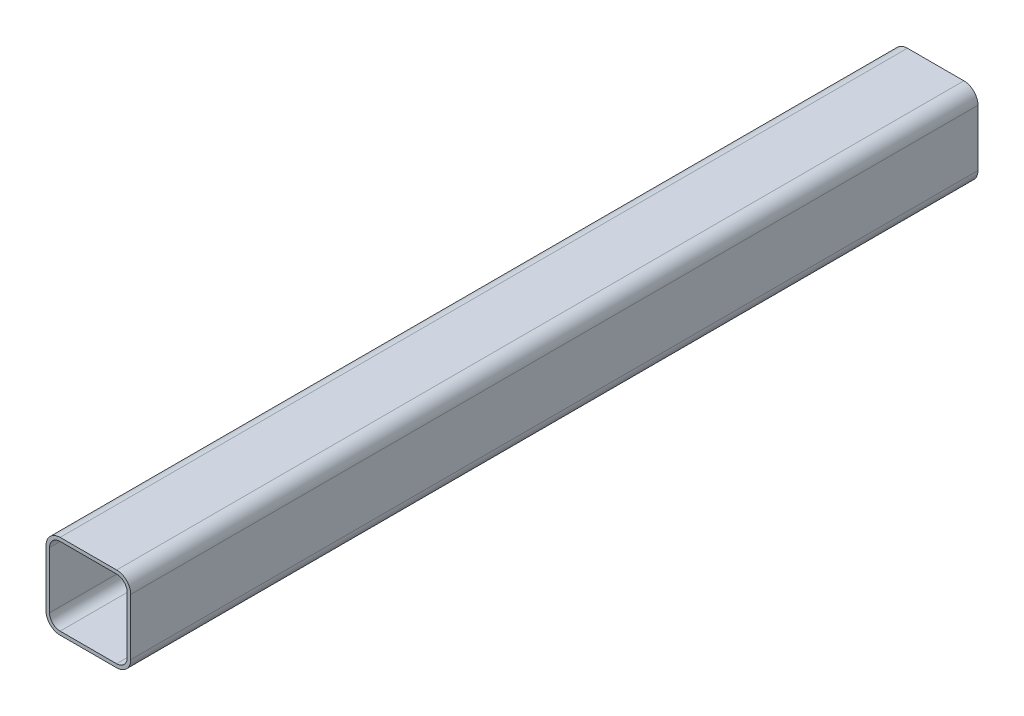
ISO-10303-21;
HEADER;
FILE_DESCRIPTION(('STEP AP214'),'2;1');
FILE_NAME('part.step','',(''),(''),'','','');
FILE_SCHEMA(('AUTOMOTIVE_DESIGN { 1 0 10303 214 1 1 1 1 }'));
ENDSEC;
DATA;
#1=APPLICATION_CONTEXT('core data for automotive mechanical design processes');
#2=APPLICATION_PROTOCOL_DEFINITION('international standard','automotive_design',2000,#1);
#3=PRODUCT_CONTEXT('',#1,'mechanical');
#4=PRODUCT('Part','Part','',(#3));
#5=PRODUCT_RELATED_PRODUCT_CATEGORY('part','',(#4));
#6=PRODUCT_DEFINITION_FORMATION('','',#4);
#7=PRODUCT_DEFINITION_CONTEXT('part definition',#1,'design');
#8=PRODUCT_DEFINITION('design','',#6,#7);
#9=PRODUCT_DEFINITION_SHAPE('','',#8);
#10=(LENGTH_UNIT() NAMED_UNIT(*) SI_UNIT(.MILLI.,.METRE.));
#11=(NAMED_UNIT(*) PLANE_ANGLE_UNIT() SI_UNIT($,.RADIAN.));
#12=(NAMED_UNIT(*) SI_UNIT($,.STERADIAN.) SOLID_ANGLE_UNIT());
#13=UNCERTAINTY_MEASURE_WITH_UNIT(LENGTH_MEASURE(1.E-05),#10,'distance_accuracy_value','');
#14=(GEOMETRIC_REPRESENTATION_CONTEXT(3) GLOBAL_UNCERTAINTY_ASSIGNED_CONTEXT((#13)) GLOBAL_UNIT_ASSIGNED_CONTEXT((#10,
#11,#12)) REPRESENTATION_CONTEXT('',''));
#15=CARTESIAN_POINT('',(0.,0.,0.));
#16=DIRECTION('',(0.,0.,1.));
#17=DIRECTION('',(1.,0.,0.));
#18=AXIS2_PLACEMENT_3D('',#15,#16,#17);
#19=CARTESIAN_POINT('',(25.4,25.4,762.));
#20=DIRECTION('',(0.,0.,1.));
#21=DIRECTION('',(1.,0.,0.));
#22=AXIS2_PLACEMENT_3D('',#19,#20,#21);
#23=PLANE('',#22);
#24=CARTESIAN_POINT('',(25.4,25.4,762.));
#25=DIRECTION('',(0.,0.,1.));
#26=DIRECTION('',(1.,0.,0.));
#27=AXIS2_PLACEMENT_3D('',#24,#25,#26);
#28=CIRCLE('',#27,12.7);
#29=CARTESIAN_POINT('',(38.1,25.4,762.));
#30=VERTEX_POINT('',#29);
#31=CARTESIAN_POINT('',(25.4,38.1,762.));
#32=VERTEX_POINT('',#31);
#33=EDGE_CURVE('E214',#30,#32,#28,.T.);
#34=ORIENTED_EDGE('',*,*,#33,.T.);
#35=DIRECTION('',(1.,0.,0.));
#36=VECTOR('',#35,1.);
#37=CARTESIAN_POINT('',(-25.4,38.1,762.));
#38=LINE('',#37,#36);
#39=CARTESIAN_POINT('',(-25.4,38.1,762.));
#40=VERTEX_POINT('',#39);
#41=EDGE_CURVE('E216',#40,#32,#38,.T.);
#42=ORIENTED_EDGE('',*,*,#41,.F.);
#43=CARTESIAN_POINT('',(-25.4,25.4,762.));
#44=DIRECTION('',(0.,0.,-1.));
#45=DIRECTION('',(-1.,0.,0.));
#46=AXIS2_PLACEMENT_3D('',#43,#44,#45);
#47=CIRCLE('',#46,12.7);
#48=CARTESIAN_POINT('',(-38.1,25.4,762.));
#49=VERTEX_POINT('',#48);
#50=EDGE_CURVE('E220',#49,#40,#47,.T.);
#51=ORIENTED_EDGE('',*,*,#50,.F.);
#52=DIRECTION('',(0.,-1.,0.));
#53=VECTOR('',#52,1.);
#54=CARTESIAN_POINT('',(-38.1,25.4,762.));
#55=LINE('',#54,#53);
#56=CARTESIAN_POINT('',(-38.1,-25.4,762.));
#57=VERTEX_POINT('',#56);
#58=EDGE_CURVE('E223',#49,#57,#55,.T.);
#59=ORIENTED_EDGE('',*,*,#58,.T.);
#60=CARTESIAN_POINT('',(-25.4,-25.4,762.));
#61=DIRECTION('',(0.,0.,-1.));
#62=DIRECTION('',(-1.,0.,0.));
#63=AXIS2_PLACEMENT_3D('',#60,#61,#62);
#64=CIRCLE('',#63,12.7);
#65=CARTESIAN_POINT('',(-25.4,-38.1,762.));
#66=VERTEX_POINT('',#65);
#67=EDGE_CURVE('E225',#66,#57,#64,.T.);
#68=ORIENTED_EDGE('',*,*,#67,.F.);
#69=DIRECTION('',(-1.,0.,0.));
#70=VECTOR('',#69,1.);
#71=CARTESIAN_POINT('',(25.4,-38.1,762.));
#72=LINE('',#71,#70);
#73=CARTESIAN_POINT('',(25.4,-38.1,762.));
#74=VERTEX_POINT('',#73);
#75=EDGE_CURVE('E228',#74,#66,#72,.T.);
#76=ORIENTED_EDGE('',*,*,#75,.F.);
#77=CARTESIAN_POINT('',(25.4,-25.4,762.));
#78=DIRECTION('',(0.,0.,-1.));
#79=DIRECTION('',(-1.,0.,0.));
#80=AXIS2_PLACEMENT_3D('',#77,#78,#79);
#81=CIRCLE('',#80,12.7);
#82=CARTESIAN_POINT('',(38.1,-25.4000000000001,762.));
#83=VERTEX_POINT('',#82);
#84=EDGE_CURVE('E231',#83,#74,#81,.T.);
#85=ORIENTED_EDGE('',*,*,#84,.F.);
#86=DIRECTION('',(0.,1.,0.));
#87=VECTOR('',#86,1.);
#88=CARTESIAN_POINT('',(38.1,-25.4000000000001,762.));
#89=LINE('',#88,#87);
#90=EDGE_CURVE('E234',#83,#30,#89,.T.);
#91=ORIENTED_EDGE('',*,*,#90,.T.);
#92=EDGE_LOOP('',(#34,#42,#51,#59,#68,#76,#85,#91));
#93=FACE_BOUND('',#92,.T.);
#94=DIRECTION('',(1.,0.,0.));
#95=VECTOR('',#94,1.);
#96=CARTESIAN_POINT('',(-25.4,34.925,762.));
#97=LINE('',#96,#95);
#98=CARTESIAN_POINT('',(-25.4,34.925,762.));
#99=VERTEX_POINT('',#98);
#100=CARTESIAN_POINT('',(25.4,34.925,762.));
#101=VERTEX_POINT('',#100);
#102=EDGE_CURVE('E154',#99,#101,#97,.T.);
#103=ORIENTED_EDGE('',*,*,#102,.T.);
#104=CARTESIAN_POINT('',(25.4,25.4,762.));
#105=DIRECTION('',(0.,0.,1.));
#106=DIRECTION('',(1.,0.,0.));
#107=AXIS2_PLACEMENT_3D('',#104,#105,#106);
#108=CIRCLE('',#107,9.525);
#109=CARTESIAN_POINT('',(34.925,25.4,762.));
#110=VERTEX_POINT('',#109);
#111=EDGE_CURVE('E145',#110,#101,#108,.T.);
#112=ORIENTED_EDGE('',*,*,#111,.F.);
#113=DIRECTION('',(0.,1.,0.));
#114=VECTOR('',#113,1.);
#115=CARTESIAN_POINT('',(34.925,-25.4000000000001,762.));
#116=LINE('',#115,#114);
#117=CARTESIAN_POINT('',(34.925,-25.4000000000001,762.));
#118=VERTEX_POINT('',#117);
#119=EDGE_CURVE('E181',#118,#110,#116,.T.);
#120=ORIENTED_EDGE('',*,*,#119,.F.);
#121=CARTESIAN_POINT('',(25.4,-25.4,762.));
#122=DIRECTION('',(0.,0.,1.));
#123=DIRECTION('',(1.,0.,0.));
#124=AXIS2_PLACEMENT_3D('',#121,#122,#123);
#125=CIRCLE('',#124,9.525);
#126=CARTESIAN_POINT('',(25.4,-34.925,762.));
#127=VERTEX_POINT('',#126);
#128=EDGE_CURVE('E49',#118,#127,#125,.F.);
#129=ORIENTED_EDGE('',*,*,#128,.T.);
#130=DIRECTION('',(-1.,0.,0.));
#131=VECTOR('',#130,1.);
#132=CARTESIAN_POINT('',(25.4,-34.925,762.));
#133=LINE('',#132,#131);
#134=CARTESIAN_POINT('',(-25.4,-34.925,762.));
#135=VERTEX_POINT('',#134);
#136=EDGE_CURVE('E177',#127,#135,#133,.T.);
#137=ORIENTED_EDGE('',*,*,#136,.T.);
#138=CARTESIAN_POINT('',(-25.4,-25.4,762.));
#139=DIRECTION('',(0.,0.,1.));
#140=DIRECTION('',(1.,0.,0.));
#141=AXIS2_PLACEMENT_3D('',#138,#139,#140);
#142=CIRCLE('',#141,9.52499999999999);
#143=CARTESIAN_POINT('',(-34.925,-25.4,762.));
#144=VERTEX_POINT('',#143);
#145=EDGE_CURVE('E174',#135,#144,#142,.F.);
#146=ORIENTED_EDGE('',*,*,#145,.T.);
#147=DIRECTION('',(0.,-1.,0.));
#148=VECTOR('',#147,1.);
#149=CARTESIAN_POINT('',(-34.925,25.4,762.));
#150=LINE('',#149,#148);
#151=CARTESIAN_POINT('',(-34.925,25.4,762.));
#152=VERTEX_POINT('',#151);
#153=EDGE_CURVE('E170',#152,#144,#150,.T.);
#154=ORIENTED_EDGE('',*,*,#153,.F.);
#155=CARTESIAN_POINT('',(-25.4,25.4,762.));
#156=DIRECTION('',(0.,0.,1.));
#157=DIRECTION('',(1.,0.,0.));
#158=AXIS2_PLACEMENT_3D('',#155,#156,#157);
#159=CIRCLE('',#158,9.525);
#160=EDGE_CURVE('E168',#152,#99,#159,.F.);
#161=ORIENTED_EDGE('',*,*,#160,.T.);
#162=EDGE_LOOP('',(#103,#112,#120,#129,#137,#146,#154,#161));
#163=FACE_BOUND('',#162,.T.);
#164=ADVANCED_FACE('F34',(#93,#163),#23,.T.);
#165=CARTESIAN_POINT('',(25.4,25.4,0.));
#166=DIRECTION('',(0.,0.,1.));
#167=DIRECTION('',(1.,0.,0.));
#168=AXIS2_PLACEMENT_3D('',#165,#166,#167);
#169=PLANE('',#168);
#170=CARTESIAN_POINT('',(25.4,25.4,0.));
#171=DIRECTION('',(0.,0.,1.));
#172=DIRECTION('',(1.,0.,0.));
#173=AXIS2_PLACEMENT_3D('',#170,#171,#172);
#174=CIRCLE('',#173,12.7);
#175=CARTESIAN_POINT('',(38.1,25.4,0.));
#176=VERTEX_POINT('',#175);
#177=CARTESIAN_POINT('',(25.4,38.1,0.));
#178=VERTEX_POINT('',#177);
#179=EDGE_CURVE('E163',#176,#178,#174,.T.);
#180=ORIENTED_EDGE('',*,*,#179,.F.);
#181=DIRECTION('',(0.,1.,0.));
#182=VECTOR('',#181,1.);
#183=CARTESIAN_POINT('',(38.1,-25.4000000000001,0.));
#184=LINE('',#183,#182);
#185=CARTESIAN_POINT('',(38.1,-25.4000000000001,0.));
#186=VERTEX_POINT('',#185);
#187=EDGE_CURVE('E217',#186,#176,#184,.T.);
#188=ORIENTED_EDGE('',*,*,#187,.F.);
#189=CARTESIAN_POINT('',(25.4,-25.4,0.));
#190=DIRECTION('',(0.,0.,-1.));
#191=DIRECTION('',(-1.,0.,0.));
#192=AXIS2_PLACEMENT_3D('',#189,#190,#191);
#193=CIRCLE('',#192,12.7);
#194=CARTESIAN_POINT('',(25.4,-38.1,0.));
#195=VERTEX_POINT('',#194);
#196=EDGE_CURVE('E254',#186,#195,#193,.T.);
#197=ORIENTED_EDGE('',*,*,#196,.T.);
#198=DIRECTION('',(-1.,0.,0.));
#199=VECTOR('',#198,1.);
#200=CARTESIAN_POINT('',(25.4,-38.1,0.));
#201=LINE('',#200,#199);
#202=CARTESIAN_POINT('',(-25.4,-38.1,0.));
#203=VERTEX_POINT('',#202);
#204=EDGE_CURVE('E251',#195,#203,#201,.T.);
#205=ORIENTED_EDGE('',*,*,#204,.T.);
#206=CARTESIAN_POINT('',(-25.4,-25.4,0.));
#207=DIRECTION('',(0.,0.,-1.));
#208=DIRECTION('',(-1.,0.,0.));
#209=AXIS2_PLACEMENT_3D('',#206,#207,#208);
#210=CIRCLE('',#209,12.7);
#211=CARTESIAN_POINT('',(-38.1,-25.4,0.));
#212=VERTEX_POINT('',#211);
#213=EDGE_CURVE('E248',#203,#212,#210,.T.);
#214=ORIENTED_EDGE('',*,*,#213,.T.);
#215=DIRECTION('',(0.,-1.,0.));
#216=VECTOR('',#215,1.);
#217=CARTESIAN_POINT('',(-38.1,25.4,0.));
#218=LINE('',#217,#216);
#219=CARTESIAN_POINT('',(-38.1,25.4,0.));
#220=VERTEX_POINT('',#219);
#221=EDGE_CURVE('E245',#220,#212,#218,.T.);
#222=ORIENTED_EDGE('',*,*,#221,.F.);
#223=CARTESIAN_POINT('',(-25.4,25.4,0.));
#224=DIRECTION('',(0.,0.,-1.));
#225=DIRECTION('',(-1.,0.,0.));
#226=AXIS2_PLACEMENT_3D('',#223,#224,#225);
#227=CIRCLE('',#226,12.7);
#228=CARTESIAN_POINT('',(-25.4,38.1,0.));
#229=VERTEX_POINT('',#228);
#230=EDGE_CURVE('E242',#220,#229,#227,.T.);
#231=ORIENTED_EDGE('',*,*,#230,.T.);
#232=DIRECTION('',(1.,0.,0.));
#233=VECTOR('',#232,1.);
#234=CARTESIAN_POINT('',(-25.4,38.1,0.));
#235=LINE('',#234,#233);
#236=EDGE_CURVE('E239',#229,#178,#235,.T.);
#237=ORIENTED_EDGE('',*,*,#236,.T.);
#238=EDGE_LOOP('',(#180,#188,#197,#205,#214,#222,#231,#237));
#239=FACE_BOUND('',#238,.T.);
#240=CARTESIAN_POINT('',(25.4,25.4,0.));
#241=DIRECTION('',(0.,0.,1.));
#242=DIRECTION('',(1.,0.,0.));
#243=AXIS2_PLACEMENT_3D('',#240,#241,#242);
#244=CIRCLE('',#243,9.525);
#245=CARTESIAN_POINT('',(34.925,25.4,0.));
#246=VERTEX_POINT('',#245);
#247=CARTESIAN_POINT('',(25.4,34.925,0.));
#248=VERTEX_POINT('',#247);
#249=EDGE_CURVE('E57',#246,#248,#244,.T.);
#250=ORIENTED_EDGE('',*,*,#249,.T.);
#251=DIRECTION('',(1.,0.,0.));
#252=VECTOR('',#251,1.);
#253=CARTESIAN_POINT('',(-25.4,34.925,0.));
#254=LINE('',#253,#252);
#255=CARTESIAN_POINT('',(-25.4,34.925,0.));
#256=VERTEX_POINT('',#255);
#257=EDGE_CURVE('E162',#256,#248,#254,.T.);
#258=ORIENTED_EDGE('',*,*,#257,.F.);
#259=CARTESIAN_POINT('',(-25.4,25.4,0.));
#260=DIRECTION('',(0.,0.,1.));
#261=DIRECTION('',(1.,0.,0.));
#262=AXIS2_PLACEMENT_3D('',#259,#260,#261);
#263=CIRCLE('',#262,9.525);
#264=CARTESIAN_POINT('',(-34.925,25.4,0.));
#265=VERTEX_POINT('',#264);
#266=EDGE_CURVE('E185',#265,#256,#263,.F.);
#267=ORIENTED_EDGE('',*,*,#266,.F.);
#268=DIRECTION('',(0.,-1.,0.));
#269=VECTOR('',#268,1.);
#270=CARTESIAN_POINT('',(-34.925,25.4,0.));
#271=LINE('',#270,#269);
#272=CARTESIAN_POINT('',(-34.925,-25.4,0.));
#273=VERTEX_POINT('',#272);
#274=EDGE_CURVE('E188',#265,#273,#271,.T.);
#275=ORIENTED_EDGE('',*,*,#274,.T.);
#276=CARTESIAN_POINT('',(-25.4,-25.4,0.));
#277=DIRECTION('',(0.,0.,1.));
#278=DIRECTION('',(1.,0.,0.));
#279=AXIS2_PLACEMENT_3D('',#276,#277,#278);
#280=CIRCLE('',#279,9.52499999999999);
#281=CARTESIAN_POINT('',(-25.4,-34.925,0.));
#282=VERTEX_POINT('',#281);
#283=EDGE_CURVE('E191',#282,#273,#280,.F.);
#284=ORIENTED_EDGE('',*,*,#283,.F.);
#285=DIRECTION('',(-1.,0.,0.));
#286=VECTOR('',#285,1.);
#287=CARTESIAN_POINT('',(25.4,-34.925,0.));
#288=LINE('',#287,#286);
#289=CARTESIAN_POINT('',(25.4,-34.925,0.));
#290=VERTEX_POINT('',#289);
#291=EDGE_CURVE('E194',#290,#282,#288,.T.);
#292=ORIENTED_EDGE('',*,*,#291,.F.);
#293=CARTESIAN_POINT('',(25.4,-25.4,0.));
#294=DIRECTION('',(0.,0.,1.));
#295=DIRECTION('',(1.,0.,0.));
#296=AXIS2_PLACEMENT_3D('',#293,#294,#295);
#297=CIRCLE('',#296,9.525);
#298=CARTESIAN_POINT('',(34.925,-25.4000000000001,0.));
#299=VERTEX_POINT('',#298);
#300=EDGE_CURVE('E197',#299,#290,#297,.F.);
#301=ORIENTED_EDGE('',*,*,#300,.F.);
#302=DIRECTION('',(0.,1.,0.));
#303=VECTOR('',#302,1.);
#304=CARTESIAN_POINT('',(34.925,-25.4000000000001,0.));
#305=LINE('',#304,#303);
#306=EDGE_CURVE('E155',#299,#246,#305,.T.);
#307=ORIENTED_EDGE('',*,*,#306,.T.);
#308=EDGE_LOOP('',(#250,#258,#267,#275,#284,#292,#301,#307));
#309=FACE_BOUND('',#308,.T.);
#310=ADVANCED_FACE('F281',(#239,#309),#169,.F.);
#311=CARTESIAN_POINT('',(25.4,25.4,762.));
#312=DIRECTION('',(0.,0.,-1.));
#313=DIRECTION('',(-1.,0.,0.));
#314=AXIS2_PLACEMENT_3D('',#311,#312,#313);
#315=CYLINDRICAL_SURFACE('',#314,12.7);
#316=ORIENTED_EDGE('',*,*,#179,.T.);
#317=DIRECTION('',(0.,0.,-1.));
#318=VECTOR('',#317,1.);
#319=CARTESIAN_POINT('',(25.4,38.1,762.));
#320=LINE('',#319,#318);
#321=EDGE_CURVE('E11',#32,#178,#320,.T.);
#322=ORIENTED_EDGE('',*,*,#321,.F.);
#323=ORIENTED_EDGE('',*,*,#33,.F.);
#324=DIRECTION('',(0.,0.,-1.));
#325=VECTOR('',#324,1.);
#326=CARTESIAN_POINT('',(38.1,25.4,762.));
#327=LINE('',#326,#325);
#328=EDGE_CURVE('E236',#30,#176,#327,.T.);
#329=ORIENTED_EDGE('',*,*,#328,.T.);
#330=EDGE_LOOP('',(#316,#322,#323,#329));
#331=FACE_BOUND('',#330,.T.);
#332=ADVANCED_FACE('F36',(#331),#315,.T.);
#333=CARTESIAN_POINT('',(-25.4,38.1,762.));
#334=DIRECTION('',(0.,1.,0.));
#335=DIRECTION('',(-1.,0.,0.));
#336=AXIS2_PLACEMENT_3D('',#333,#334,#335);
#337=PLANE('',#336);
#338=ORIENTED_EDGE('',*,*,#236,.F.);
#339=DIRECTION('',(0.,0.,-1.));
#340=VECTOR('',#339,1.);
#341=CARTESIAN_POINT('',(-25.4,38.1,762.));
#342=LINE('',#341,#340);
#343=EDGE_CURVE('E42',#40,#229,#342,.T.);
#344=ORIENTED_EDGE('',*,*,#343,.F.);
#345=ORIENTED_EDGE('',*,*,#41,.T.);
#346=ORIENTED_EDGE('',*,*,#321,.T.);
#347=EDGE_LOOP('',(#338,#344,#345,#346));
#348=FACE_BOUND('',#347,.T.);
#349=ADVANCED_FACE('F276',(#348),#337,.T.);
#350=CARTESIAN_POINT('',(-25.4,25.4,762.));
#351=DIRECTION('',(0.,0.,-1.));
#352=DIRECTION('',(-1.,0.,0.));
#353=AXIS2_PLACEMENT_3D('',#350,#351,#352);
#354=CYLINDRICAL_SURFACE('',#353,12.7);
#355=ORIENTED_EDGE('',*,*,#230,.F.);
#356=DIRECTION('',(0.,0.,-1.));
#357=VECTOR('',#356,1.);
#358=CARTESIAN_POINT('',(-38.1,25.4,762.));
#359=LINE('',#358,#357);
#360=EDGE_CURVE('E268',#49,#220,#359,.T.);
#361=ORIENTED_EDGE('',*,*,#360,.F.);
#362=ORIENTED_EDGE('',*,*,#50,.T.);
#363=ORIENTED_EDGE('',*,*,#343,.T.);
#364=EDGE_LOOP('',(#355,#361,#362,#363));
#365=FACE_BOUND('',#364,.T.);
#366=ADVANCED_FACE('F272',(#365),#354,.T.);
#367=CARTESIAN_POINT('',(-38.1,25.4,762.));
#368=DIRECTION('',(1.,0.,0.));
#369=DIRECTION('',(0.,1.,0.));
#370=AXIS2_PLACEMENT_3D('',#367,#368,#369);
#371=PLANE('',#370);
#372=ORIENTED_EDGE('',*,*,#221,.T.);
#373=DIRECTION('',(0.,0.,-1.));
#374=VECTOR('',#373,1.);
#375=CARTESIAN_POINT('',(-38.1,-25.4,762.));
#376=LINE('',#375,#374);
#377=EDGE_CURVE('E266',#57,#212,#376,.T.);
#378=ORIENTED_EDGE('',*,*,#377,.F.);
#379=ORIENTED_EDGE('',*,*,#58,.F.);
#380=ORIENTED_EDGE('',*,*,#360,.T.);
#381=EDGE_LOOP('',(#372,#378,#379,#380));
#382=FACE_BOUND('',#381,.T.);
#383=ADVANCED_FACE('F286',(#382),#371,.F.);
#384=CARTESIAN_POINT('',(-25.4,-25.4,762.));
#385=DIRECTION('',(0.,0.,-1.));
#386=DIRECTION('',(-1.,0.,0.));
#387=AXIS2_PLACEMENT_3D('',#384,#385,#386);
#388=CYLINDRICAL_SURFACE('',#387,12.7);
#389=ORIENTED_EDGE('',*,*,#213,.F.);
#390=DIRECTION('',(0.,0.,-1.));
#391=VECTOR('',#390,1.);
#392=CARTESIAN_POINT('',(-25.4,-38.1,762.));
#393=LINE('',#392,#391);
#394=EDGE_CURVE('E264',#66,#203,#393,.T.);
#395=ORIENTED_EDGE('',*,*,#394,.F.);
#396=ORIENTED_EDGE('',*,*,#67,.T.);
#397=ORIENTED_EDGE('',*,*,#377,.T.);
#398=EDGE_LOOP('',(#389,#395,#396,#397));
#399=FACE_BOUND('',#398,.T.);
#400=ADVANCED_FACE('F305',(#399),#388,.T.);
#401=CARTESIAN_POINT('',(25.4,-38.1,762.));
#402=DIRECTION('',(0.,-1.,0.));
#403=DIRECTION('',(1.,0.,0.));
#404=AXIS2_PLACEMENT_3D('',#401,#402,#403);
#405=PLANE('',#404);
#406=ORIENTED_EDGE('',*,*,#204,.F.);
#407=DIRECTION('',(0.,0.,-1.));
#408=VECTOR('',#407,1.);
#409=CARTESIAN_POINT('',(25.4,-38.1,762.));
#410=LINE('',#409,#408);
#411=EDGE_CURVE('E262',#74,#195,#410,.T.);
#412=ORIENTED_EDGE('',*,*,#411,.F.);
#413=ORIENTED_EDGE('',*,*,#75,.T.);
#414=ORIENTED_EDGE('',*,*,#394,.T.);
#415=EDGE_LOOP('',(#406,#412,#413,#414));
#416=FACE_BOUND('',#415,.T.);
#417=ADVANCED_FACE('F303',(#416),#405,.T.);
#418=CARTESIAN_POINT('',(25.4,-25.4,762.));
#419=DIRECTION('',(0.,0.,-1.));
#420=DIRECTION('',(-1.,0.,0.));
#421=AXIS2_PLACEMENT_3D('',#418,#419,#420);
#422=CYLINDRICAL_SURFACE('',#421,12.7);
#423=ORIENTED_EDGE('',*,*,#196,.F.);
#424=DIRECTION('',(0.,0.,-1.));
#425=VECTOR('',#424,1.);
#426=CARTESIAN_POINT('',(38.1,-25.4000000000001,762.));
#427=LINE('',#426,#425);
#428=EDGE_CURVE('E260',#83,#186,#427,.T.);
#429=ORIENTED_EDGE('',*,*,#428,.F.);
#430=ORIENTED_EDGE('',*,*,#84,.T.);
#431=ORIENTED_EDGE('',*,*,#411,.T.);
#432=EDGE_LOOP('',(#423,#429,#430,#431));
#433=FACE_BOUND('',#432,.T.);
#434=ADVANCED_FACE('F299',(#433),#422,.T.);
#435=CARTESIAN_POINT('',(38.1,-25.4000000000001,762.));
#436=DIRECTION('',(-1.,0.,0.));
#437=DIRECTION('',(0.,-1.,0.));
#438=AXIS2_PLACEMENT_3D('',#435,#436,#437);
#439=PLANE('',#438);
#440=ORIENTED_EDGE('',*,*,#187,.T.);
#441=ORIENTED_EDGE('',*,*,#328,.F.);
#442=ORIENTED_EDGE('',*,*,#90,.F.);
#443=ORIENTED_EDGE('',*,*,#428,.T.);
#444=EDGE_LOOP('',(#440,#441,#442,#443));
#445=FACE_BOUND('',#444,.T.);
#446=ADVANCED_FACE('F323',(#445),#439,.F.);
#447=CARTESIAN_POINT('',(25.4,25.4,762.));
#448=DIRECTION('',(0.,0.,-1.));
#449=DIRECTION('',(-1.,0.,0.));
#450=AXIS2_PLACEMENT_3D('',#447,#448,#449);
#451=CYLINDRICAL_SURFACE('',#450,9.525);
#452=ORIENTED_EDGE('',*,*,#249,.F.);
#453=DIRECTION('',(0.,0.,-1.));
#454=VECTOR('',#453,1.);
#455=CARTESIAN_POINT('',(34.925,25.4,762.));
#456=LINE('',#455,#454);
#457=EDGE_CURVE('E150',#110,#246,#456,.T.);
#458=ORIENTED_EDGE('',*,*,#457,.F.);
#459=ORIENTED_EDGE('',*,*,#111,.T.);
#460=DIRECTION('',(0.,0.,-1.));
#461=VECTOR('',#460,1.);
#462=CARTESIAN_POINT('',(25.4,34.925,762.));
#463=LINE('',#462,#461);
#464=EDGE_CURVE('E148',#101,#248,#463,.T.);
#465=ORIENTED_EDGE('',*,*,#464,.T.);
#466=EDGE_LOOP('',(#452,#458,#459,#465));
#467=FACE_BOUND('',#466,.T.);
#468=ADVANCED_FACE('F147',(#467),#451,.F.);
#469=CARTESIAN_POINT('',(-25.4,34.925,762.));
#470=DIRECTION('',(0.,1.,0.));
#471=DIRECTION('',(-1.,0.,0.));
#472=AXIS2_PLACEMENT_3D('',#469,#470,#471);
#473=PLANE('',#472);
#474=ORIENTED_EDGE('',*,*,#257,.T.);
#475=ORIENTED_EDGE('',*,*,#464,.F.);
#476=ORIENTED_EDGE('',*,*,#102,.F.);
#477=DIRECTION('',(0.,0.,-1.));
#478=VECTOR('',#477,1.);
#479=CARTESIAN_POINT('',(-25.4,34.925,762.));
#480=LINE('',#479,#478);
#481=EDGE_CURVE('E164',#99,#256,#480,.T.);
#482=ORIENTED_EDGE('',*,*,#481,.T.);
#483=EDGE_LOOP('',(#474,#475,#476,#482));
#484=FACE_BOUND('',#483,.T.);
#485=ADVANCED_FACE('F159',(#484),#473,.F.);
#486=CARTESIAN_POINT('',(-25.4,25.4,762.));
#487=DIRECTION('',(0.,0.,-1.));
#488=DIRECTION('',(-1.,0.,0.));
#489=AXIS2_PLACEMENT_3D('',#486,#487,#488);
#490=CYLINDRICAL_SURFACE('',#489,9.525);
#491=ORIENTED_EDGE('',*,*,#266,.T.);
#492=ORIENTED_EDGE('',*,*,#481,.F.);
#493=ORIENTED_EDGE('',*,*,#160,.F.);
#494=DIRECTION('',(0.,0.,-1.));
#495=VECTOR('',#494,1.);
#496=CARTESIAN_POINT('',(-34.925,25.4,762.));
#497=LINE('',#496,#495);
#498=EDGE_CURVE('E211',#152,#265,#497,.T.);
#499=ORIENTED_EDGE('',*,*,#498,.T.);
#500=EDGE_LOOP('',(#491,#492,#493,#499));
#501=FACE_BOUND('',#500,.T.);
#502=ADVANCED_FACE('F346',(#501),#490,.F.);
#503=CARTESIAN_POINT('',(-34.925,25.4,762.));
#504=DIRECTION('',(1.,0.,0.));
#505=DIRECTION('',(0.,1.,0.));
#506=AXIS2_PLACEMENT_3D('',#503,#504,#505);
#507=PLANE('',#506);
#508=ORIENTED_EDGE('',*,*,#274,.F.);
#509=ORIENTED_EDGE('',*,*,#498,.F.);
#510=ORIENTED_EDGE('',*,*,#153,.T.);
#511=DIRECTION('',(0.,0.,-1.));
#512=VECTOR('',#511,1.);
#513=CARTESIAN_POINT('',(-34.925,-25.4,762.));
#514=LINE('',#513,#512);
#515=EDGE_CURVE('E209',#144,#273,#514,.T.);
#516=ORIENTED_EDGE('',*,*,#515,.T.);
#517=EDGE_LOOP('',(#508,#509,#510,#516));
#518=FACE_BOUND('',#517,.T.);
#519=ADVANCED_FACE('F352',(#518),#507,.T.);
#520=CARTESIAN_POINT('',(-25.4,-25.4,762.));
#521=DIRECTION('',(0.,0.,-1.));
#522=DIRECTION('',(-1.,0.,0.));
#523=AXIS2_PLACEMENT_3D('',#520,#521,#522);
#524=CYLINDRICAL_SURFACE('',#523,9.52499999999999);
#525=ORIENTED_EDGE('',*,*,#283,.T.);
#526=ORIENTED_EDGE('',*,*,#515,.F.);
#527=ORIENTED_EDGE('',*,*,#145,.F.);
#528=DIRECTION('',(0.,0.,-1.));
#529=VECTOR('',#528,1.);
#530=CARTESIAN_POINT('',(-25.4,-34.925,762.));
#531=LINE('',#530,#529);
#532=EDGE_CURVE('E207',#135,#282,#531,.T.);
#533=ORIENTED_EDGE('',*,*,#532,.T.);
#534=EDGE_LOOP('',(#525,#526,#527,#533));
#535=FACE_BOUND('',#534,.T.);
#536=ADVANCED_FACE('F360',(#535),#524,.F.);
#537=CARTESIAN_POINT('',(25.4,-34.925,762.));
#538=DIRECTION('',(0.,-1.,0.));
#539=DIRECTION('',(1.,0.,0.));
#540=AXIS2_PLACEMENT_3D('',#537,#538,#539);
#541=PLANE('',#540);
#542=ORIENTED_EDGE('',*,*,#291,.T.);
#543=ORIENTED_EDGE('',*,*,#532,.F.);
#544=ORIENTED_EDGE('',*,*,#136,.F.);
#545=DIRECTION('',(0.,0.,-1.));
#546=VECTOR('',#545,1.);
#547=CARTESIAN_POINT('',(25.4,-34.925,762.));
#548=LINE('',#547,#546);
#549=EDGE_CURVE('E205',#127,#290,#548,.T.);
#550=ORIENTED_EDGE('',*,*,#549,.T.);
#551=EDGE_LOOP('',(#542,#543,#544,#550));
#552=FACE_BOUND('',#551,.T.);
#553=ADVANCED_FACE('F368',(#552),#541,.F.);
#554=CARTESIAN_POINT('',(25.4,-25.4,762.));
#555=DIRECTION('',(0.,0.,-1.));
#556=DIRECTION('',(-1.,0.,0.));
#557=AXIS2_PLACEMENT_3D('',#554,#555,#556);
#558=CYLINDRICAL_SURFACE('',#557,9.525);
#559=ORIENTED_EDGE('',*,*,#300,.T.);
#560=ORIENTED_EDGE('',*,*,#549,.F.);
#561=ORIENTED_EDGE('',*,*,#128,.F.);
#562=DIRECTION('',(0.,0.,-1.));
#563=VECTOR('',#562,1.);
#564=CARTESIAN_POINT('',(34.925,-25.4000000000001,762.));
#565=LINE('',#564,#563);
#566=EDGE_CURVE('E203',#118,#299,#565,.T.);
#567=ORIENTED_EDGE('',*,*,#566,.T.);
#568=EDGE_LOOP('',(#559,#560,#561,#567));
#569=FACE_BOUND('',#568,.T.);
#570=ADVANCED_FACE('F376',(#569),#558,.F.);
#571=CARTESIAN_POINT('',(34.925,-25.4000000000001,762.));
#572=DIRECTION('',(-1.,0.,0.));
#573=DIRECTION('',(0.,-1.,0.));
#574=AXIS2_PLACEMENT_3D('',#571,#572,#573);
#575=PLANE('',#574);
#576=ORIENTED_EDGE('',*,*,#306,.F.);
#577=ORIENTED_EDGE('',*,*,#566,.F.);
#578=ORIENTED_EDGE('',*,*,#119,.T.);
#579=ORIENTED_EDGE('',*,*,#457,.T.);
#580=EDGE_LOOP('',(#576,#577,#578,#579));
#581=FACE_BOUND('',#580,.T.);
#582=ADVANCED_FACE('F384',(#581),#575,.T.);
#583=CLOSED_SHELL('',(#164,#310,#332,#349,#366,#383,#400,#417,#434,#446,#468,#485,#502,#519,
#536,#553,#570,#582));
#584=MANIFOLD_SOLID_BREP('B2',#583);
#585=ADVANCED_BREP_SHAPE_REPRESENTATION('',(#18,#584),#14);
#586=SHAPE_DEFINITION_REPRESENTATION(#9,#585);
ENDSEC;
END-ISO-10303-21;
